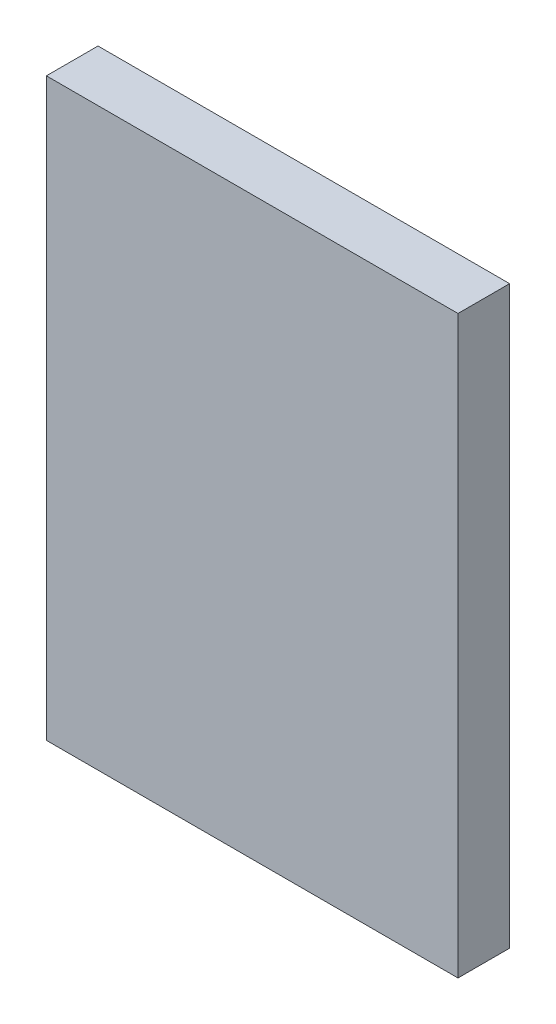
from build123d import *

# Parameters (mm, degrees)
SKETCH1_W           = 69.85
SKETCH1_H           = 97.663
BOSS_EXTRUDE1_DEPTH = 8.763


with BuildPart() as part:
    # Sketch1 → Boss-Extrude1 (new body)
    with BuildSketch(Plane.XY):
        with Locations((34.925, 48.8315)):
            Rectangle(SKETCH1_W, SKETCH1_H)
    extrude(amount=BOSS_EXTRUDE1_DEPTH)


solid = part.part
